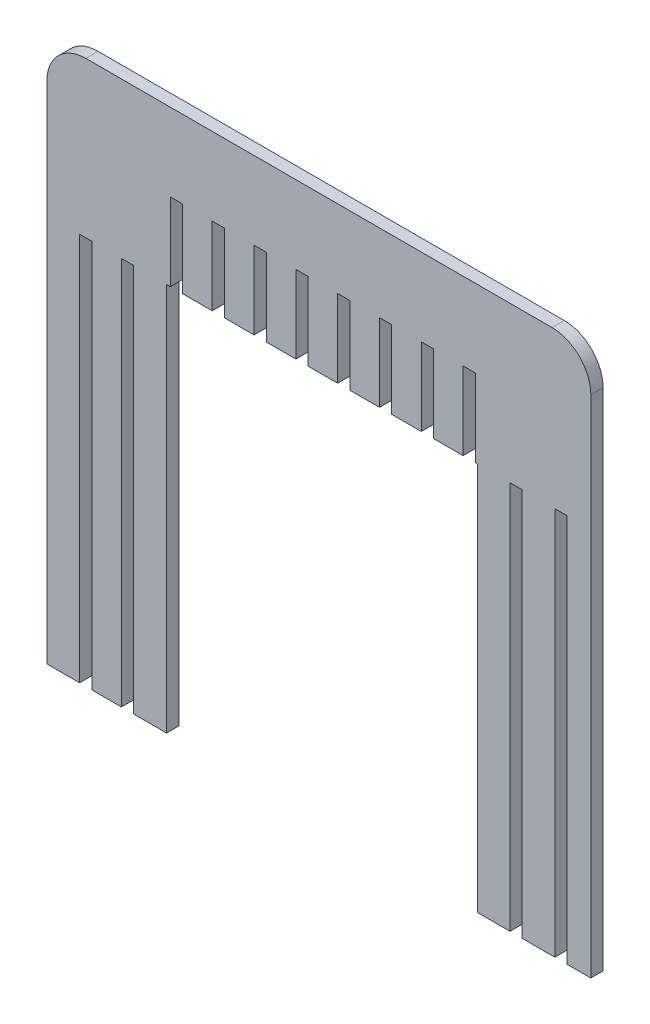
from build123d import *

# Parameters (mm, degrees)
BOSS_EXTRUDE1_DEPTH = 4.000000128
FILLET1_R           = 12.7
FILLET2_R           = 12.7


with BuildPart() as part:
    # Sketch1 → Boss-Extrude1 (new body)
    with BuildSketch(Plane.XY):
        Polygon((-60.563999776, -88.9), (-49.799999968, -88.9), (-49.799999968, 38.1), (-48.529999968, 38.1), (-48.529999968, 63.5), (-44.52999984, 63.5), (-44.52999984, 38.1), (-34.861999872, 38.1), (-34.861999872, 63.5), (-30.861999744, 63.5), (-30.861999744, 38.1), (-21.193999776, 38.1), (-21.193999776, 63.5), (-17.193999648, 63.5), (-17.193999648, 38.1), (-7.52599968, 38.1), (-7.52599968, 63.5), (-3.525999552, 63.5), (-3.525999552, 38.1), (6.142000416, 38.1), (6.142000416, 63.5), (10.142000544, 63.5), (10.142000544, 38.1), (19.810000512, 38.1), (19.810000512, 63.5), (23.81000064, 63.5), (23.81000064, 38.1), (33.478000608, 38.1), (33.478000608, 63.5), (37.478000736, 63.5), (37.478000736, 38.1), (47.146000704, 38.1), (47.146000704, 63.5), (51.146000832, 63.5), (51.146000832, 38.1), (51.800000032, 38.1), (51.800000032, -88.9), (62.468000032, -88.9), (62.468000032, 38.1), (66.46800016, 38.1), (66.46800016, -88.9), (77.13600016, -88.9), (77.13600016, 38.1), (81.136000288, 38.1), (81.136000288, -88.9), (88.9, -88.9), (88.9, 88.9), (-88.9, 88.9), (-88.9, -88.9), (-78.232, -88.9), (-78.232, 38.1), (-74.231999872, 38.1), (-74.231999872, -88.9), (-64.563999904, -88.9), (-64.563999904, 38.1), (-60.563999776, 38.1), align=None)
    extrude(amount=BOSS_EXTRUDE1_DEPTH)

    # Fillet1
    fillet1_edges = [part.edges().sort_by_distance(p)[0] for p in [
        (88.9, 88.9, 2.000000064),
    ]]
    fillet(fillet1_edges, radius=FILLET1_R)

    # Fillet2
    fillet2_edges = [part.edges().sort_by_distance(p)[0] for p in [
        (-88.9, 88.9, 2.000000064),
    ]]
    fillet(fillet2_edges, radius=FILLET2_R)


solid = part.part
